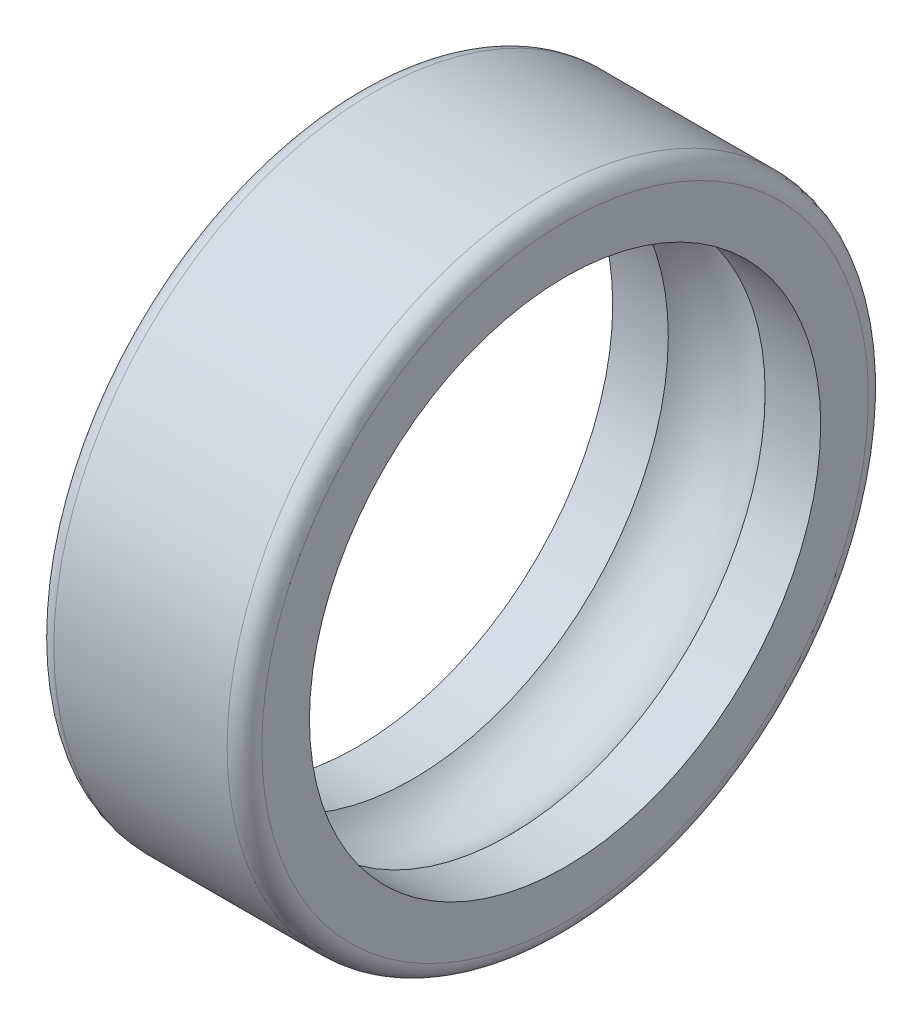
ISO-10303-21;
HEADER;
FILE_DESCRIPTION(('STEP AP214'),'2;1');
FILE_NAME('part.step','',(''),(''),'','','');
FILE_SCHEMA(('AUTOMOTIVE_DESIGN { 1 0 10303 214 1 1 1 1 }'));
ENDSEC;
DATA;
#1=APPLICATION_CONTEXT('core data for automotive mechanical design processes');
#2=APPLICATION_PROTOCOL_DEFINITION('international standard','automotive_design',2000,#1);
#3=PRODUCT_CONTEXT('',#1,'mechanical');
#4=PRODUCT('Part','Part','',(#3));
#5=PRODUCT_RELATED_PRODUCT_CATEGORY('part','',(#4));
#6=PRODUCT_DEFINITION_FORMATION('','',#4);
#7=PRODUCT_DEFINITION_CONTEXT('part definition',#1,'design');
#8=PRODUCT_DEFINITION('design','',#6,#7);
#9=PRODUCT_DEFINITION_SHAPE('','',#8);
#10=(LENGTH_UNIT() NAMED_UNIT(*) SI_UNIT(.MILLI.,.METRE.));
#11=(NAMED_UNIT(*) PLANE_ANGLE_UNIT() SI_UNIT($,.RADIAN.));
#12=(NAMED_UNIT(*) SI_UNIT($,.STERADIAN.) SOLID_ANGLE_UNIT());
#13=UNCERTAINTY_MEASURE_WITH_UNIT(LENGTH_MEASURE(1.E-05),#10,'distance_accuracy_value','');
#14=(GEOMETRIC_REPRESENTATION_CONTEXT(3) GLOBAL_UNCERTAINTY_ASSIGNED_CONTEXT((#13)) GLOBAL_UNIT_ASSIGNED_CONTEXT((#10,
#11,#12)) REPRESENTATION_CONTEXT('',''));
#15=CARTESIAN_POINT('',(0.,0.,0.));
#16=DIRECTION('',(0.,0.,1.));
#17=DIRECTION('',(1.,0.,0.));
#18=AXIS2_PLACEMENT_3D('',#15,#16,#17);
#19=CARTESIAN_POINT('',(1.,0.,0.));
#20=DIRECTION('',(-1.,0.,0.));
#21=DIRECTION('',(0.,0.,1.));
#22=AXIS2_PLACEMENT_3D('',#19,#20,#21);
#23=TOROIDAL_SURFACE('',#22,17.5,1.);
#24=CARTESIAN_POINT('',(0.,0.,0.));
#25=DIRECTION('',(-1.,0.,0.));
#26=DIRECTION('',(0.,0.,1.));
#27=AXIS2_PLACEMENT_3D('',#24,#25,#26);
#28=CIRCLE('',#27,17.5);
#29=CARTESIAN_POINT('',(0.,0.,17.5));
#30=VERTEX_POINT('',#29);
#31=EDGE_CURVE('E10',#30,#30,#28,.T.);
#32=ORIENTED_EDGE('',*,*,#31,.F.);
#33=EDGE_LOOP('',(#32));
#34=FACE_BOUND('',#33,.T.);
#35=CARTESIAN_POINT('',(1.,0.,0.));
#36=DIRECTION('',(-1.,0.,0.));
#37=DIRECTION('',(0.,0.,1.));
#38=AXIS2_PLACEMENT_3D('',#35,#36,#37);
#39=CIRCLE('',#38,18.5);
#40=CARTESIAN_POINT('',(1.,0.,18.5));
#41=VERTEX_POINT('',#40);
#42=EDGE_CURVE('E55',#41,#41,#39,.T.);
#43=ORIENTED_EDGE('',*,*,#42,.T.);
#44=EDGE_LOOP('',(#43));
#45=FACE_BOUND('',#44,.T.);
#46=ADVANCED_FACE('F27',(#34,#45),#23,.T.);
#47=CARTESIAN_POINT('',(0.,0.,-17.5));
#48=DIRECTION('',(1.,0.,0.));
#49=DIRECTION('',(0.,0.,-1.));
#50=AXIS2_PLACEMENT_3D('',#47,#48,#49);
#51=PLANE('',#50);
#52=CARTESIAN_POINT('',(0.,0.,0.));
#53=DIRECTION('',(-1.,0.,0.));
#54=DIRECTION('',(0.,0.,1.));
#55=AXIS2_PLACEMENT_3D('',#52,#53,#54);
#56=CIRCLE('',#55,14.75);
#57=CARTESIAN_POINT('',(0.,0.,14.75));
#58=VERTEX_POINT('',#57);
#59=EDGE_CURVE('E33',#58,#58,#56,.T.);
#60=ORIENTED_EDGE('',*,*,#59,.F.);
#61=EDGE_LOOP('',(#60));
#62=FACE_BOUND('',#61,.T.);
#63=ORIENTED_EDGE('',*,*,#31,.T.);
#64=EDGE_LOOP('',(#63));
#65=FACE_BOUND('',#64,.T.);
#66=ADVANCED_FACE('F92',(#62,#65),#51,.F.);
#67=CARTESIAN_POINT('',(0.,0.,0.));
#68=DIRECTION('',(-1.,0.,0.));
#69=DIRECTION('',(0.,0.,1.));
#70=AXIS2_PLACEMENT_3D('',#67,#68,#69);
#71=CYLINDRICAL_SURFACE('',#70,14.75);
#72=CARTESIAN_POINT('',(3.20491502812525,0.,0.));
#73=DIRECTION('',(-1.,0.,0.));
#74=DIRECTION('',(0.,0.,1.));
#75=AXIS2_PLACEMENT_3D('',#72,#73,#74);
#76=CIRCLE('',#75,14.75);
#77=CARTESIAN_POINT('',(3.20491502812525,0.,14.75));
#78=VERTEX_POINT('',#77);
#79=EDGE_CURVE('E37',#78,#78,#76,.T.);
#80=ORIENTED_EDGE('',*,*,#79,.F.);
#81=EDGE_LOOP('',(#80));
#82=FACE_BOUND('',#81,.T.);
#83=ORIENTED_EDGE('',*,*,#59,.T.);
#84=EDGE_LOOP('',(#83));
#85=FACE_BOUND('',#84,.T.);
#86=ADVANCED_FACE('F87',(#82,#85),#71,.F.);
#87=CARTESIAN_POINT('',(6.00000000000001,0.,0.));
#88=DIRECTION('',(-1.,0.,0.));
#89=DIRECTION('',(0.,0.,1.));
#90=AXIS2_PLACEMENT_3D('',#87,#88,#89);
#91=TOROIDAL_SURFACE('',#90,12.25,3.75);
#92=CARTESIAN_POINT('',(8.79508497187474,0.,0.));
#93=DIRECTION('',(-1.,0.,0.));
#94=DIRECTION('',(0.,0.,1.));
#95=AXIS2_PLACEMENT_3D('',#92,#93,#94);
#96=CIRCLE('',#95,14.75);
#97=CARTESIAN_POINT('',(8.79508497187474,0.,14.75));
#98=VERTEX_POINT('',#97);
#99=EDGE_CURVE('E41',#98,#98,#96,.T.);
#100=ORIENTED_EDGE('',*,*,#99,.F.);
#101=EDGE_LOOP('',(#100));
#102=FACE_BOUND('',#101,.T.);
#103=ORIENTED_EDGE('',*,*,#79,.T.);
#104=EDGE_LOOP('',(#103));
#105=FACE_BOUND('',#104,.T.);
#106=ADVANCED_FACE('F81',(#102,#105),#91,.F.);
#107=CARTESIAN_POINT('',(0.,0.,0.));
#108=DIRECTION('',(-1.,0.,0.));
#109=DIRECTION('',(0.,0.,1.));
#110=AXIS2_PLACEMENT_3D('',#107,#108,#109);
#111=CYLINDRICAL_SURFACE('',#110,14.75);
#112=CARTESIAN_POINT('',(12.,0.,0.));
#113=DIRECTION('',(-1.,0.,0.));
#114=DIRECTION('',(0.,0.,1.));
#115=AXIS2_PLACEMENT_3D('',#112,#113,#114);
#116=CIRCLE('',#115,14.75);
#117=CARTESIAN_POINT('',(12.,0.,14.75));
#118=VERTEX_POINT('',#117);
#119=EDGE_CURVE('E46',#118,#118,#116,.T.);
#120=ORIENTED_EDGE('',*,*,#119,.F.);
#121=EDGE_LOOP('',(#120));
#122=FACE_BOUND('',#121,.T.);
#123=ORIENTED_EDGE('',*,*,#99,.T.);
#124=EDGE_LOOP('',(#123));
#125=FACE_BOUND('',#124,.T.);
#126=ADVANCED_FACE('F75',(#122,#125),#111,.F.);
#127=CARTESIAN_POINT('',(12.,0.,-17.5));
#128=DIRECTION('',(-1.,0.,0.));
#129=DIRECTION('',(0.,0.,1.));
#130=AXIS2_PLACEMENT_3D('',#127,#128,#129);
#131=PLANE('',#130);
#132=CARTESIAN_POINT('',(12.,0.,0.));
#133=DIRECTION('',(-1.,0.,0.));
#134=DIRECTION('',(0.,0.,1.));
#135=AXIS2_PLACEMENT_3D('',#132,#133,#134);
#136=CIRCLE('',#135,17.5);
#137=CARTESIAN_POINT('',(12.,0.,17.5));
#138=VERTEX_POINT('',#137);
#139=EDGE_CURVE('E49',#138,#138,#136,.T.);
#140=ORIENTED_EDGE('',*,*,#139,.F.);
#141=EDGE_LOOP('',(#140));
#142=FACE_BOUND('',#141,.T.);
#143=ORIENTED_EDGE('',*,*,#119,.T.);
#144=EDGE_LOOP('',(#143));
#145=FACE_BOUND('',#144,.T.);
#146=ADVANCED_FACE('F69',(#142,#145),#131,.F.);
#147=CARTESIAN_POINT('',(11.,0.,0.));
#148=DIRECTION('',(-1.,0.,0.));
#149=DIRECTION('',(0.,0.,1.));
#150=AXIS2_PLACEMENT_3D('',#147,#148,#149);
#151=TOROIDAL_SURFACE('',#150,17.5,1.);
#152=CARTESIAN_POINT('',(11.,0.,0.));
#153=DIRECTION('',(-1.,0.,0.));
#154=DIRECTION('',(0.,0.,1.));
#155=AXIS2_PLACEMENT_3D('',#152,#153,#154);
#156=CIRCLE('',#155,18.5);
#157=CARTESIAN_POINT('',(11.,0.,18.5));
#158=VERTEX_POINT('',#157);
#159=EDGE_CURVE('E52',#158,#158,#156,.T.);
#160=ORIENTED_EDGE('',*,*,#159,.F.);
#161=EDGE_LOOP('',(#160));
#162=FACE_BOUND('',#161,.T.);
#163=ORIENTED_EDGE('',*,*,#139,.T.);
#164=EDGE_LOOP('',(#163));
#165=FACE_BOUND('',#164,.T.);
#166=ADVANCED_FACE('F63',(#162,#165),#151,.T.);
#167=CARTESIAN_POINT('',(0.,0.,0.));
#168=DIRECTION('',(-1.,0.,0.));
#169=DIRECTION('',(0.,0.,1.));
#170=AXIS2_PLACEMENT_3D('',#167,#168,#169);
#171=CYLINDRICAL_SURFACE('',#170,18.5);
#172=ORIENTED_EDGE('',*,*,#42,.F.);
#173=EDGE_LOOP('',(#172));
#174=FACE_BOUND('',#173,.T.);
#175=ORIENTED_EDGE('',*,*,#159,.T.);
#176=EDGE_LOOP('',(#175));
#177=FACE_BOUND('',#176,.T.);
#178=ADVANCED_FACE('F60',(#174,#177),#171,.T.);
#179=CLOSED_SHELL('',(#46,#66,#86,#106,#126,#146,#166,#178));
#180=MANIFOLD_SOLID_BREP('B2',#179);
#181=ADVANCED_BREP_SHAPE_REPRESENTATION('',(#18,#180),#14);
#182=SHAPE_DEFINITION_REPRESENTATION(#9,#181);
ENDSEC;
END-ISO-10303-21;
